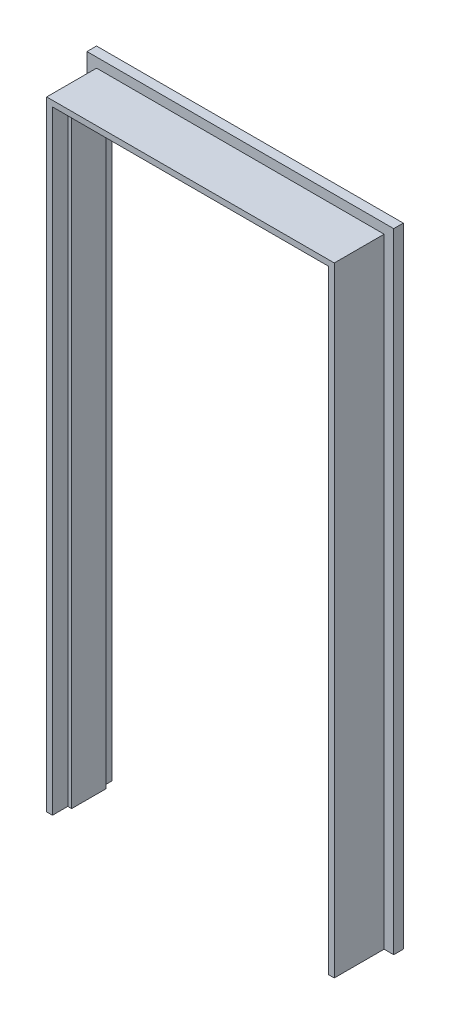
ISO-10303-21;
HEADER;
FILE_DESCRIPTION(('STEP AP214'),'2;1');
FILE_NAME('part.step','',(''),(''),'','','');
FILE_SCHEMA(('AUTOMOTIVE_DESIGN { 1 0 10303 214 1 1 1 1 }'));
ENDSEC;
DATA;
#1=APPLICATION_CONTEXT('core data for automotive mechanical design processes');
#2=APPLICATION_PROTOCOL_DEFINITION('international standard','automotive_design',2000,#1);
#3=PRODUCT_CONTEXT('',#1,'mechanical');
#4=PRODUCT('Part','Part','',(#3));
#5=PRODUCT_RELATED_PRODUCT_CATEGORY('part','',(#4));
#6=PRODUCT_DEFINITION_FORMATION('','',#4);
#7=PRODUCT_DEFINITION_CONTEXT('part definition',#1,'design');
#8=PRODUCT_DEFINITION('design','',#6,#7);
#9=PRODUCT_DEFINITION_SHAPE('','',#8);
#10=(LENGTH_UNIT() NAMED_UNIT(*) SI_UNIT(.MILLI.,.METRE.));
#11=(NAMED_UNIT(*) PLANE_ANGLE_UNIT() SI_UNIT($,.RADIAN.));
#12=(NAMED_UNIT(*) SI_UNIT($,.STERADIAN.) SOLID_ANGLE_UNIT());
#13=UNCERTAINTY_MEASURE_WITH_UNIT(LENGTH_MEASURE(1.E-05),#10,'distance_accuracy_value','');
#14=(GEOMETRIC_REPRESENTATION_CONTEXT(3) GLOBAL_UNCERTAINTY_ASSIGNED_CONTEXT((#13)) GLOBAL_UNIT_ASSIGNED_CONTEXT((#10,
#11,#12)) REPRESENTATION_CONTEXT('',''));
#15=CARTESIAN_POINT('',(0.,0.,0.));
#16=DIRECTION('',(0.,0.,1.));
#17=DIRECTION('',(1.,0.,0.));
#18=AXIS2_PLACEMENT_3D('',#15,#16,#17);
#19=CARTESIAN_POINT('',(457.2,0.,165.1));
#20=DIRECTION('',(1.,0.,0.));
#21=DIRECTION('',(0.,0.,-1.));
#22=AXIS2_PLACEMENT_3D('',#19,#20,#21);
#23=PLANE('',#22);
#24=DIRECTION('',(0.,1.,0.));
#25=VECTOR('',#24,1.);
#26=CARTESIAN_POINT('',(457.2,0.,114.3));
#27=LINE('',#26,#25);
#28=CARTESIAN_POINT('',(457.2,0.,114.3));
#29=VERTEX_POINT('',#28);
#30=CARTESIAN_POINT('',(457.2,2032.,114.3));
#31=VERTEX_POINT('',#30);
#32=EDGE_CURVE('E364',#29,#31,#27,.T.);
#33=ORIENTED_EDGE('',*,*,#32,.F.);
#34=DIRECTION('',(0.,0.,-1.));
#35=VECTOR('',#34,1.);
#36=CARTESIAN_POINT('',(457.2,0.,165.1));
#37=LINE('',#36,#35);
#38=CARTESIAN_POINT('',(457.2,0.,165.1));
#39=VERTEX_POINT('',#38);
#40=EDGE_CURVE('E11',#39,#29,#37,.T.);
#41=ORIENTED_EDGE('',*,*,#40,.F.);
#42=DIRECTION('',(0.,-1.,0.));
#43=VECTOR('',#42,1.);
#44=CARTESIAN_POINT('',(457.2,0.,165.1));
#45=LINE('',#44,#43);
#46=CARTESIAN_POINT('',(457.2,2032.,165.1));
#47=VERTEX_POINT('',#46);
#48=EDGE_CURVE('E231',#47,#39,#45,.T.);
#49=ORIENTED_EDGE('',*,*,#48,.F.);
#50=DIRECTION('',(0.,0.,-1.));
#51=VECTOR('',#50,1.);
#52=CARTESIAN_POINT('',(457.2,2032.,165.1));
#53=LINE('',#52,#51);
#54=EDGE_CURVE('E227',#47,#31,#53,.T.);
#55=ORIENTED_EDGE('',*,*,#54,.T.);
#56=EDGE_LOOP('',(#33,#41,#49,#55));
#57=FACE_BOUND('',#56,.T.);
#58=ADVANCED_FACE('F35',(#57),#23,.F.);
#59=CARTESIAN_POINT('',(-457.2,0.,165.1));
#60=DIRECTION('',(-1.,0.,0.));
#61=DIRECTION('',(0.,0.,1.));
#62=AXIS2_PLACEMENT_3D('',#59,#60,#61);
#63=PLANE('',#62);
#64=DIRECTION('',(0.,-1.,0.));
#65=VECTOR('',#64,1.);
#66=CARTESIAN_POINT('',(-457.2,-2.22044604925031E-13,114.3));
#67=LINE('',#66,#65);
#68=CARTESIAN_POINT('',(-457.2,2032.,114.3));
#69=VERTEX_POINT('',#68);
#70=CARTESIAN_POINT('',(-457.2,0.,114.3));
#71=VERTEX_POINT('',#70);
#72=EDGE_CURVE('E359',#69,#71,#67,.T.);
#73=ORIENTED_EDGE('',*,*,#72,.F.);
#74=DIRECTION('',(0.,0.,-1.));
#75=VECTOR('',#74,1.);
#76=CARTESIAN_POINT('',(-457.2,2032.,165.1));
#77=LINE('',#76,#75);
#78=CARTESIAN_POINT('',(-457.2,2032.,165.1));
#79=VERTEX_POINT('',#78);
#80=EDGE_CURVE('E308',#79,#69,#77,.T.);
#81=ORIENTED_EDGE('',*,*,#80,.F.);
#82=DIRECTION('',(0.,1.,0.));
#83=VECTOR('',#82,1.);
#84=CARTESIAN_POINT('',(-457.2,0.,165.1));
#85=LINE('',#84,#83);
#86=CARTESIAN_POINT('',(-457.2,0.,165.1));
#87=VERTEX_POINT('',#86);
#88=EDGE_CURVE('E320',#87,#79,#85,.T.);
#89=ORIENTED_EDGE('',*,*,#88,.F.);
#90=DIRECTION('',(0.,0.,-1.));
#91=VECTOR('',#90,1.);
#92=CARTESIAN_POINT('',(-457.2,0.,165.1));
#93=LINE('',#92,#91);
#94=EDGE_CURVE('E306',#87,#71,#93,.T.);
#95=ORIENTED_EDGE('',*,*,#94,.T.);
#96=EDGE_LOOP('',(#73,#81,#89,#95));
#97=FACE_BOUND('',#96,.T.);
#98=ADVANCED_FACE('F383',(#97),#63,.F.);
#99=CARTESIAN_POINT('',(-457.2,2032.,165.1));
#100=DIRECTION('',(0.,1.,0.));
#101=DIRECTION('',(0.,0.,1.));
#102=AXIS2_PLACEMENT_3D('',#99,#100,#101);
#103=PLANE('',#102);
#104=DIRECTION('',(-1.,0.,0.));
#105=VECTOR('',#104,1.);
#106=CARTESIAN_POINT('',(457.2,2032.,114.3));
#107=LINE('',#106,#105);
#108=EDGE_CURVE('E362',#31,#69,#107,.T.);
#109=ORIENTED_EDGE('',*,*,#108,.F.);
#110=ORIENTED_EDGE('',*,*,#54,.F.);
#111=DIRECTION('',(1.,0.,0.));
#112=VECTOR('',#111,1.);
#113=CARTESIAN_POINT('',(-457.2,2032.,165.1));
#114=LINE('',#113,#112);
#115=EDGE_CURVE('E315',#79,#47,#114,.T.);
#116=ORIENTED_EDGE('',*,*,#115,.F.);
#117=ORIENTED_EDGE('',*,*,#80,.T.);
#118=EDGE_LOOP('',(#109,#110,#116,#117));
#119=FACE_BOUND('',#118,.T.);
#120=ADVANCED_FACE('F384',(#119),#103,.F.);
#121=CARTESIAN_POINT('',(457.2,0.,165.1));
#122=DIRECTION('',(0.,1.,0.));
#123=DIRECTION('',(0.,0.,1.));
#124=AXIS2_PLACEMENT_3D('',#121,#122,#123);
#125=PLANE('',#124);
#126=DIRECTION('',(1.,0.,0.));
#127=VECTOR('',#126,1.);
#128=CARTESIAN_POINT('',(457.2,0.,0.));
#129=LINE('',#128,#127);
#130=CARTESIAN_POINT('',(444.5,0.,0.));
#131=VERTEX_POINT('',#130);
#132=CARTESIAN_POINT('',(457.2,0.,0.));
#133=VERTEX_POINT('',#132);
#134=EDGE_CURVE('E196',#131,#133,#129,.T.);
#135=ORIENTED_EDGE('',*,*,#134,.T.);
#136=DIRECTION('',(0.,0.,1.));
#137=VECTOR('',#136,1.);
#138=CARTESIAN_POINT('',(457.2,0.,-31.75));
#139=LINE('',#138,#137);
#140=CARTESIAN_POINT('',(457.2,0.,-31.75));
#141=VERTEX_POINT('',#140);
#142=EDGE_CURVE('E176',#141,#133,#139,.T.);
#143=ORIENTED_EDGE('',*,*,#142,.F.);
#144=DIRECTION('',(-1.,0.,0.));
#145=VECTOR('',#144,1.);
#146=CARTESIAN_POINT('',(-1802.65041251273,0.,-31.75));
#147=LINE('',#146,#145);
#148=CARTESIAN_POINT('',(508.,0.,-31.75));
#149=VERTEX_POINT('',#148);
#150=EDGE_CURVE('E182',#149,#141,#147,.T.);
#151=ORIENTED_EDGE('',*,*,#150,.F.);
#152=DIRECTION('',(0.,0.,1.));
#153=VECTOR('',#152,1.);
#154=CARTESIAN_POINT('',(508.,0.,-31.75));
#155=LINE('',#154,#153);
#156=CARTESIAN_POINT('',(508.,0.,0.));
#157=VERTEX_POINT('',#156);
#158=EDGE_CURVE('E276',#149,#157,#155,.T.);
#159=ORIENTED_EDGE('',*,*,#158,.T.);
#160=DIRECTION('',(-1.,0.,0.));
#161=VECTOR('',#160,1.);
#162=CARTESIAN_POINT('',(-1802.65041251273,0.,0.));
#163=LINE('',#162,#161);
#164=CARTESIAN_POINT('',(476.25,0.,0.));
#165=VERTEX_POINT('',#164);
#166=EDGE_CURVE('E234',#157,#165,#163,.T.);
#167=ORIENTED_EDGE('',*,*,#166,.T.);
#168=DIRECTION('',(0.,0.,-1.));
#169=VECTOR('',#168,1.);
#170=CARTESIAN_POINT('',(476.25,0.,165.1));
#171=LINE('',#170,#169);
#172=CARTESIAN_POINT('',(476.25,0.,165.1));
#173=VERTEX_POINT('',#172);
#174=EDGE_CURVE('E43',#173,#165,#171,.T.);
#175=ORIENTED_EDGE('',*,*,#174,.F.);
#176=DIRECTION('',(1.,0.,0.));
#177=VECTOR('',#176,1.);
#178=CARTESIAN_POINT('',(457.2,0.,165.1));
#179=LINE('',#178,#177);
#180=EDGE_CURVE('E332',#39,#173,#179,.T.);
#181=ORIENTED_EDGE('',*,*,#180,.F.);
#182=ORIENTED_EDGE('',*,*,#40,.T.);
#183=DIRECTION('',(1.,0.,0.));
#184=VECTOR('',#183,1.);
#185=CARTESIAN_POINT('',(457.2,0.,114.3));
#186=LINE('',#185,#184);
#187=CARTESIAN_POINT('',(444.5,0.,114.3));
#188=VERTEX_POINT('',#187);
#189=EDGE_CURVE('E350',#188,#29,#186,.T.);
#190=ORIENTED_EDGE('',*,*,#189,.F.);
#191=DIRECTION('',(0.,0.,-1.));
#192=VECTOR('',#191,1.);
#193=CARTESIAN_POINT('',(444.5,0.,114.3));
#194=LINE('',#193,#192);
#195=EDGE_CURVE('E344',#188,#131,#194,.T.);
#196=ORIENTED_EDGE('',*,*,#195,.T.);
#197=EDGE_LOOP('',(#135,#143,#151,#159,#167,#175,#181,#182,#190,#196));
#198=FACE_BOUND('',#197,.T.);
#199=ADVANCED_FACE('F194',(#198),#125,.F.);
#200=CARTESIAN_POINT('',(476.25,0.,165.1));
#201=DIRECTION('',(-1.,0.,0.));
#202=DIRECTION('',(0.,0.,1.));
#203=AXIS2_PLACEMENT_3D('',#200,#201,#202);
#204=PLANE('',#203);
#205=DIRECTION('',(0.,1.,0.));
#206=VECTOR('',#205,1.);
#207=CARTESIAN_POINT('',(476.25,0.,0.));
#208=LINE('',#207,#206);
#209=CARTESIAN_POINT('',(476.25,2051.05,0.));
#210=VERTEX_POINT('',#209);
#211=EDGE_CURVE('E213',#165,#210,#208,.T.);
#212=ORIENTED_EDGE('',*,*,#211,.T.);
#213=DIRECTION('',(0.,0.,-1.));
#214=VECTOR('',#213,1.);
#215=CARTESIAN_POINT('',(476.25,2051.05,165.1));
#216=LINE('',#215,#214);
#217=CARTESIAN_POINT('',(476.25,2051.05,165.1));
#218=VERTEX_POINT('',#217);
#219=EDGE_CURVE('E210',#218,#210,#216,.T.);
#220=ORIENTED_EDGE('',*,*,#219,.F.);
#221=DIRECTION('',(0.,1.,0.));
#222=VECTOR('',#221,1.);
#223=CARTESIAN_POINT('',(476.25,0.,165.1));
#224=LINE('',#223,#222);
#225=EDGE_CURVE('E330',#173,#218,#224,.T.);
#226=ORIENTED_EDGE('',*,*,#225,.F.);
#227=ORIENTED_EDGE('',*,*,#174,.T.);
#228=EDGE_LOOP('',(#212,#220,#226,#227));
#229=FACE_BOUND('',#228,.T.);
#230=ADVANCED_FACE('F376',(#229),#204,.F.);
#231=CARTESIAN_POINT('',(-476.25,2051.05,165.1));
#232=DIRECTION('',(0.,-1.,0.));
#233=DIRECTION('',(0.,0.,-1.));
#234=AXIS2_PLACEMENT_3D('',#231,#232,#233);
#235=PLANE('',#234);
#236=DIRECTION('',(-1.,0.,0.));
#237=VECTOR('',#236,1.);
#238=CARTESIAN_POINT('',(-476.25,2051.05,0.));
#239=LINE('',#238,#237);
#240=CARTESIAN_POINT('',(-476.25,2051.05,0.));
#241=VERTEX_POINT('',#240);
#242=EDGE_CURVE('E216',#210,#241,#239,.T.);
#243=ORIENTED_EDGE('',*,*,#242,.T.);
#244=DIRECTION('',(0.,0.,-1.));
#245=VECTOR('',#244,1.);
#246=CARTESIAN_POINT('',(-476.25,2051.05,165.1));
#247=LINE('',#246,#245);
#248=CARTESIAN_POINT('',(-476.25,2051.05,165.1));
#249=VERTEX_POINT('',#248);
#250=EDGE_CURVE('E299',#249,#241,#247,.T.);
#251=ORIENTED_EDGE('',*,*,#250,.F.);
#252=DIRECTION('',(-1.,0.,0.));
#253=VECTOR('',#252,1.);
#254=CARTESIAN_POINT('',(-476.25,2051.05,165.1));
#255=LINE('',#254,#253);
#256=EDGE_CURVE('E328',#218,#249,#255,.T.);
#257=ORIENTED_EDGE('',*,*,#256,.F.);
#258=ORIENTED_EDGE('',*,*,#219,.T.);
#259=EDGE_LOOP('',(#243,#251,#257,#258));
#260=FACE_BOUND('',#259,.T.);
#261=ADVANCED_FACE('F377',(#260),#235,.F.);
#262=CARTESIAN_POINT('',(-476.25,0.,165.1));
#263=DIRECTION('',(1.,0.,0.));
#264=DIRECTION('',(0.,0.,-1.));
#265=AXIS2_PLACEMENT_3D('',#262,#263,#264);
#266=PLANE('',#265);
#267=DIRECTION('',(0.,-1.,0.));
#268=VECTOR('',#267,1.);
#269=CARTESIAN_POINT('',(-476.25,0.,0.));
#270=LINE('',#269,#268);
#271=CARTESIAN_POINT('',(-476.25,0.,0.));
#272=VERTEX_POINT('',#271);
#273=EDGE_CURVE('E217',#241,#272,#270,.T.);
#274=ORIENTED_EDGE('',*,*,#273,.T.);
#275=DIRECTION('',(0.,0.,-1.));
#276=VECTOR('',#275,1.);
#277=CARTESIAN_POINT('',(-476.25,0.,165.1));
#278=LINE('',#277,#276);
#279=CARTESIAN_POINT('',(-476.25,0.,165.1));
#280=VERTEX_POINT('',#279);
#281=EDGE_CURVE('E289',#280,#272,#278,.T.);
#282=ORIENTED_EDGE('',*,*,#281,.F.);
#283=DIRECTION('',(0.,-1.,0.));
#284=VECTOR('',#283,1.);
#285=CARTESIAN_POINT('',(-476.25,0.,165.1));
#286=LINE('',#285,#284);
#287=EDGE_CURVE('E300',#249,#280,#286,.T.);
#288=ORIENTED_EDGE('',*,*,#287,.F.);
#289=ORIENTED_EDGE('',*,*,#250,.T.);
#290=EDGE_LOOP('',(#274,#282,#288,#289));
#291=FACE_BOUND('',#290,.T.);
#292=ADVANCED_FACE('F296',(#291),#266,.F.);
#293=CARTESIAN_POINT('',(-476.25,0.,165.1));
#294=DIRECTION('',(0.,1.,0.));
#295=DIRECTION('',(0.,0.,1.));
#296=AXIS2_PLACEMENT_3D('',#293,#294,#295);
#297=PLANE('',#296);
#298=ORIENTED_EDGE('',*,*,#281,.T.);
#299=DIRECTION('',(-1.,0.,0.));
#300=VECTOR('',#299,1.);
#301=CARTESIAN_POINT('',(-1802.65041251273,0.,0.));
#302=LINE('',#301,#300);
#303=CARTESIAN_POINT('',(-508.,0.,0.));
#304=VERTEX_POINT('',#303);
#305=EDGE_CURVE('E243',#272,#304,#302,.T.);
#306=ORIENTED_EDGE('',*,*,#305,.T.);
#307=DIRECTION('',(0.,0.,1.));
#308=VECTOR('',#307,1.);
#309=CARTESIAN_POINT('',(-508.,0.,-31.75));
#310=LINE('',#309,#308);
#311=CARTESIAN_POINT('',(-508.,0.,-31.75));
#312=VERTEX_POINT('',#311);
#313=EDGE_CURVE('E259',#312,#304,#310,.T.);
#314=ORIENTED_EDGE('',*,*,#313,.F.);
#315=DIRECTION('',(-1.,0.,0.));
#316=VECTOR('',#315,1.);
#317=CARTESIAN_POINT('',(-1802.65041251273,0.,-31.75));
#318=LINE('',#317,#316);
#319=CARTESIAN_POINT('',(-457.2,0.,-31.75));
#320=VERTEX_POINT('',#319);
#321=EDGE_CURVE('E405',#320,#312,#318,.T.);
#322=ORIENTED_EDGE('',*,*,#321,.F.);
#323=DIRECTION('',(0.,0.,1.));
#324=VECTOR('',#323,1.);
#325=CARTESIAN_POINT('',(-457.2,0.,-31.75));
#326=LINE('',#325,#324);
#327=CARTESIAN_POINT('',(-457.2,0.,0.));
#328=VERTEX_POINT('',#327);
#329=EDGE_CURVE('E257',#320,#328,#326,.T.);
#330=ORIENTED_EDGE('',*,*,#329,.T.);
#331=DIRECTION('',(1.,0.,0.));
#332=VECTOR('',#331,1.);
#333=CARTESIAN_POINT('',(-476.25,0.,0.));
#334=LINE('',#333,#332);
#335=CARTESIAN_POINT('',(-444.5,0.,0.));
#336=VERTEX_POINT('',#335);
#337=EDGE_CURVE('E56',#328,#336,#334,.T.);
#338=ORIENTED_EDGE('',*,*,#337,.T.);
#339=DIRECTION('',(0.,0.,-1.));
#340=VECTOR('',#339,1.);
#341=CARTESIAN_POINT('',(-444.5,0.,114.3));
#342=LINE('',#341,#340);
#343=CARTESIAN_POINT('',(-444.5,0.,114.3));
#344=VERTEX_POINT('',#343);
#345=EDGE_CURVE('E335',#344,#336,#342,.T.);
#346=ORIENTED_EDGE('',*,*,#345,.F.);
#347=DIRECTION('',(1.,0.,0.));
#348=VECTOR('',#347,1.);
#349=CARTESIAN_POINT('',(-457.2,-2.22044604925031E-13,114.3));
#350=LINE('',#349,#348);
#351=EDGE_CURVE('E357',#71,#344,#350,.T.);
#352=ORIENTED_EDGE('',*,*,#351,.F.);
#353=ORIENTED_EDGE('',*,*,#94,.F.);
#354=DIRECTION('',(1.,0.,0.));
#355=VECTOR('',#354,1.);
#356=CARTESIAN_POINT('',(-476.25,0.,165.1));
#357=LINE('',#356,#355);
#358=EDGE_CURVE('E323',#280,#87,#357,.T.);
#359=ORIENTED_EDGE('',*,*,#358,.F.);
#360=EDGE_LOOP('',(#298,#306,#314,#322,#330,#338,#346,#352,#353,#359));
#361=FACE_BOUND('',#360,.T.);
#362=ADVANCED_FACE('F286',(#361),#297,.F.);
#363=CARTESIAN_POINT('',(457.2,2032.,165.1));
#364=DIRECTION('',(0.,0.,-1.));
#365=DIRECTION('',(-1.,0.,0.));
#366=AXIS2_PLACEMENT_3D('',#363,#364,#365);
#367=PLANE('',#366);
#368=ORIENTED_EDGE('',*,*,#48,.T.);
#369=ORIENTED_EDGE('',*,*,#180,.T.);
#370=ORIENTED_EDGE('',*,*,#225,.T.);
#371=ORIENTED_EDGE('',*,*,#256,.T.);
#372=ORIENTED_EDGE('',*,*,#287,.T.);
#373=ORIENTED_EDGE('',*,*,#358,.T.);
#374=ORIENTED_EDGE('',*,*,#88,.T.);
#375=ORIENTED_EDGE('',*,*,#115,.T.);
#376=EDGE_LOOP('',(#368,#369,#370,#371,#372,#373,#374,#375));
#377=FACE_BOUND('',#376,.T.);
#378=ADVANCED_FACE('F372',(#377),#367,.F.);
#379=CARTESIAN_POINT('',(457.2,2032.,0.));
#380=DIRECTION('',(0.,0.,-1.));
#381=DIRECTION('',(-1.,0.,0.));
#382=AXIS2_PLACEMENT_3D('',#379,#380,#381);
#383=PLANE('',#382);
#384=DIRECTION('',(0.,-1.,0.));
#385=VECTOR('',#384,1.);
#386=CARTESIAN_POINT('',(-457.2,1041.4,0.));
#387=LINE('',#386,#385);
#388=CARTESIAN_POINT('',(-457.2,2032.,0.));
#389=VERTEX_POINT('',#388);
#390=EDGE_CURVE('E51',#389,#328,#387,.T.);
#391=ORIENTED_EDGE('',*,*,#390,.F.);
#392=DIRECTION('',(-1.,0.,0.));
#393=VECTOR('',#392,1.);
#394=CARTESIAN_POINT('',(-1802.65041251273,2032.,0.));
#395=LINE('',#394,#393);
#396=CARTESIAN_POINT('',(457.2,2032.,0.));
#397=VERTEX_POINT('',#396);
#398=EDGE_CURVE('E233',#397,#389,#395,.T.);
#399=ORIENTED_EDGE('',*,*,#398,.F.);
#400=DIRECTION('',(0.,1.,0.));
#401=VECTOR('',#400,1.);
#402=CARTESIAN_POINT('',(457.2,1041.4,0.));
#403=LINE('',#402,#401);
#404=EDGE_CURVE('E232',#133,#397,#403,.T.);
#405=ORIENTED_EDGE('',*,*,#404,.F.);
#406=ORIENTED_EDGE('',*,*,#134,.F.);
#407=DIRECTION('',(0.,-1.,0.));
#408=VECTOR('',#407,1.);
#409=CARTESIAN_POINT('',(444.5,0.,0.));
#410=LINE('',#409,#408);
#411=CARTESIAN_POINT('',(444.5,2019.3,0.));
#412=VERTEX_POINT('',#411);
#413=EDGE_CURVE('E347',#412,#131,#410,.T.);
#414=ORIENTED_EDGE('',*,*,#413,.F.);
#415=DIRECTION('',(1.,0.,0.));
#416=VECTOR('',#415,1.);
#417=CARTESIAN_POINT('',(444.5,2019.3,0.));
#418=LINE('',#417,#416);
#419=CARTESIAN_POINT('',(-444.5,2019.3,0.));
#420=VERTEX_POINT('',#419);
#421=EDGE_CURVE('E199',#420,#412,#418,.T.);
#422=ORIENTED_EDGE('',*,*,#421,.F.);
#423=DIRECTION('',(0.,1.,0.));
#424=VECTOR('',#423,1.);
#425=CARTESIAN_POINT('',(-444.5,0.,0.));
#426=LINE('',#425,#424);
#427=EDGE_CURVE('E197',#336,#420,#426,.T.);
#428=ORIENTED_EDGE('',*,*,#427,.F.);
#429=ORIENTED_EDGE('',*,*,#337,.F.);
#430=EDGE_LOOP('',(#391,#399,#405,#406,#414,#422,#428,#429));
#431=FACE_BOUND('',#430,.T.);
#432=ADVANCED_FACE('F397',(#431),#383,.T.);
#433=CARTESIAN_POINT('',(-444.5,0.,114.3));
#434=DIRECTION('',(-1.,0.,0.));
#435=DIRECTION('',(0.,0.,1.));
#436=AXIS2_PLACEMENT_3D('',#433,#434,#435);
#437=PLANE('',#436);
#438=ORIENTED_EDGE('',*,*,#427,.T.);
#439=DIRECTION('',(0.,0.,-1.));
#440=VECTOR('',#439,1.);
#441=CARTESIAN_POINT('',(-444.5,2019.3,114.3));
#442=LINE('',#441,#440);
#443=CARTESIAN_POINT('',(-444.5,2019.3,114.3));
#444=VERTEX_POINT('',#443);
#445=EDGE_CURVE('E338',#444,#420,#442,.T.);
#446=ORIENTED_EDGE('',*,*,#445,.F.);
#447=DIRECTION('',(0.,1.,0.));
#448=VECTOR('',#447,1.);
#449=CARTESIAN_POINT('',(-444.5,0.,114.3));
#450=LINE('',#449,#448);
#451=EDGE_CURVE('E355',#344,#444,#450,.T.);
#452=ORIENTED_EDGE('',*,*,#451,.F.);
#453=ORIENTED_EDGE('',*,*,#345,.T.);
#454=EDGE_LOOP('',(#438,#446,#452,#453));
#455=FACE_BOUND('',#454,.T.);
#456=ADVANCED_FACE('F388',(#455),#437,.F.);
#457=CARTESIAN_POINT('',(444.5,2019.3,114.3));
#458=DIRECTION('',(0.,1.,0.));
#459=DIRECTION('',(0.,0.,1.));
#460=AXIS2_PLACEMENT_3D('',#457,#458,#459);
#461=PLANE('',#460);
#462=ORIENTED_EDGE('',*,*,#421,.T.);
#463=DIRECTION('',(0.,0.,-1.));
#464=VECTOR('',#463,1.);
#465=CARTESIAN_POINT('',(444.5,2019.3,114.3));
#466=LINE('',#465,#464);
#467=CARTESIAN_POINT('',(444.5,2019.3,114.3));
#468=VERTEX_POINT('',#467);
#469=EDGE_CURVE('E341',#468,#412,#466,.T.);
#470=ORIENTED_EDGE('',*,*,#469,.F.);
#471=DIRECTION('',(1.,0.,0.));
#472=VECTOR('',#471,1.);
#473=CARTESIAN_POINT('',(444.5,2019.3,114.3));
#474=LINE('',#473,#472);
#475=EDGE_CURVE('E353',#444,#468,#474,.T.);
#476=ORIENTED_EDGE('',*,*,#475,.F.);
#477=ORIENTED_EDGE('',*,*,#445,.T.);
#478=EDGE_LOOP('',(#462,#470,#476,#477));
#479=FACE_BOUND('',#478,.T.);
#480=ADVANCED_FACE('F393',(#479),#461,.F.);
#481=CARTESIAN_POINT('',(444.5,0.,114.3));
#482=DIRECTION('',(1.,0.,0.));
#483=DIRECTION('',(0.,0.,-1.));
#484=AXIS2_PLACEMENT_3D('',#481,#482,#483);
#485=PLANE('',#484);
#486=ORIENTED_EDGE('',*,*,#413,.T.);
#487=ORIENTED_EDGE('',*,*,#195,.F.);
#488=DIRECTION('',(0.,-1.,0.));
#489=VECTOR('',#488,1.);
#490=CARTESIAN_POINT('',(444.5,0.,114.3));
#491=LINE('',#490,#489);
#492=EDGE_CURVE('E346',#468,#188,#491,.T.);
#493=ORIENTED_EDGE('',*,*,#492,.F.);
#494=ORIENTED_EDGE('',*,*,#469,.T.);
#495=EDGE_LOOP('',(#486,#487,#493,#494));
#496=FACE_BOUND('',#495,.T.);
#497=ADVANCED_FACE('F396',(#496),#485,.F.);
#498=CARTESIAN_POINT('',(444.5,0.,114.3));
#499=DIRECTION('',(0.,0.,-1.));
#500=DIRECTION('',(-1.,0.,0.));
#501=AXIS2_PLACEMENT_3D('',#498,#499,#500);
#502=PLANE('',#501);
#503=ORIENTED_EDGE('',*,*,#189,.T.);
#504=ORIENTED_EDGE('',*,*,#32,.T.);
#505=ORIENTED_EDGE('',*,*,#108,.T.);
#506=ORIENTED_EDGE('',*,*,#72,.T.);
#507=ORIENTED_EDGE('',*,*,#351,.T.);
#508=ORIENTED_EDGE('',*,*,#451,.T.);
#509=ORIENTED_EDGE('',*,*,#475,.T.);
#510=ORIENTED_EDGE('',*,*,#492,.T.);
#511=EDGE_LOOP('',(#503,#504,#505,#506,#507,#508,#509,#510));
#512=FACE_BOUND('',#511,.T.);
#513=ADVANCED_FACE('F368',(#512),#502,.F.);
#514=CARTESIAN_POINT('',(457.2,1041.4,-31.75));
#515=DIRECTION('',(1.,0.,0.));
#516=DIRECTION('',(0.,0.,-1.));
#517=AXIS2_PLACEMENT_3D('',#514,#515,#516);
#518=PLANE('',#517);
#519=ORIENTED_EDGE('',*,*,#404,.T.);
#520=DIRECTION('',(0.,0.,1.));
#521=VECTOR('',#520,1.);
#522=CARTESIAN_POINT('',(457.2,2032.,-31.75));
#523=LINE('',#522,#521);
#524=CARTESIAN_POINT('',(457.2,2032.,-31.75));
#525=VERTEX_POINT('',#524);
#526=EDGE_CURVE('E178',#525,#397,#523,.T.);
#527=ORIENTED_EDGE('',*,*,#526,.F.);
#528=DIRECTION('',(0.,1.,0.));
#529=VECTOR('',#528,1.);
#530=CARTESIAN_POINT('',(457.2,1041.4,-31.75));
#531=LINE('',#530,#529);
#532=EDGE_CURVE('E171',#141,#525,#531,.T.);
#533=ORIENTED_EDGE('',*,*,#532,.F.);
#534=ORIENTED_EDGE('',*,*,#142,.T.);
#535=EDGE_LOOP('',(#519,#527,#533,#534));
#536=FACE_BOUND('',#535,.T.);
#537=ADVANCED_FACE('F174',(#536),#518,.F.);
#538=CARTESIAN_POINT('',(-1802.65041251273,2032.,-31.75));
#539=DIRECTION('',(0.,1.,0.));
#540=DIRECTION('',(0.,0.,1.));
#541=AXIS2_PLACEMENT_3D('',#538,#539,#540);
#542=PLANE('',#541);
#543=ORIENTED_EDGE('',*,*,#398,.T.);
#544=DIRECTION('',(0.,0.,1.));
#545=VECTOR('',#544,1.);
#546=CARTESIAN_POINT('',(-457.2,2032.,-31.75));
#547=LINE('',#546,#545);
#548=CARTESIAN_POINT('',(-457.2,2032.,-31.75));
#549=VERTEX_POINT('',#548);
#550=EDGE_CURVE('E201',#549,#389,#547,.T.);
#551=ORIENTED_EDGE('',*,*,#550,.F.);
#552=DIRECTION('',(-1.,0.,0.));
#553=VECTOR('',#552,1.);
#554=CARTESIAN_POINT('',(-1802.65041251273,2032.,-31.75));
#555=LINE('',#554,#553);
#556=EDGE_CURVE('E181',#525,#549,#555,.T.);
#557=ORIENTED_EDGE('',*,*,#556,.F.);
#558=ORIENTED_EDGE('',*,*,#526,.T.);
#559=EDGE_LOOP('',(#543,#551,#557,#558));
#560=FACE_BOUND('',#559,.T.);
#561=ADVANCED_FACE('F400',(#560),#542,.F.);
#562=CARTESIAN_POINT('',(-457.2,1041.4,-31.75));
#563=DIRECTION('',(-1.,0.,0.));
#564=DIRECTION('',(0.,0.,1.));
#565=AXIS2_PLACEMENT_3D('',#562,#563,#564);
#566=PLANE('',#565);
#567=ORIENTED_EDGE('',*,*,#390,.T.);
#568=ORIENTED_EDGE('',*,*,#329,.F.);
#569=DIRECTION('',(0.,-1.,0.));
#570=VECTOR('',#569,1.);
#571=CARTESIAN_POINT('',(-457.2,1041.4,-31.75));
#572=LINE('',#571,#570);
#573=EDGE_CURVE('E404',#549,#320,#572,.T.);
#574=ORIENTED_EDGE('',*,*,#573,.F.);
#575=ORIENTED_EDGE('',*,*,#550,.T.);
#576=EDGE_LOOP('',(#567,#568,#574,#575));
#577=FACE_BOUND('',#576,.T.);
#578=ADVANCED_FACE('F403',(#577),#566,.F.);
#579=CARTESIAN_POINT('',(-508.,1041.4,-31.75));
#580=DIRECTION('',(-1.,0.,0.));
#581=DIRECTION('',(0.,-1.,0.));
#582=AXIS2_PLACEMENT_3D('',#579,#580,#581);
#583=PLANE('',#582);
#584=DIRECTION('',(0.,-1.,0.));
#585=VECTOR('',#584,1.);
#586=CARTESIAN_POINT('',(-508.,1041.4,0.));
#587=LINE('',#586,#585);
#588=CARTESIAN_POINT('',(-508.,2082.8,0.));
#589=VERTEX_POINT('',#588);
#590=EDGE_CURVE('E282',#589,#304,#587,.T.);
#591=ORIENTED_EDGE('',*,*,#590,.F.);
#592=DIRECTION('',(0.,0.,1.));
#593=VECTOR('',#592,1.);
#594=CARTESIAN_POINT('',(-508.,2082.8,-31.75));
#595=LINE('',#594,#593);
#596=CARTESIAN_POINT('',(-508.,2082.8,-31.75));
#597=VERTEX_POINT('',#596);
#598=EDGE_CURVE('E265',#597,#589,#595,.T.);
#599=ORIENTED_EDGE('',*,*,#598,.F.);
#600=DIRECTION('',(0.,-1.,0.));
#601=VECTOR('',#600,1.);
#602=CARTESIAN_POINT('',(-508.,1041.4,-31.75));
#603=LINE('',#602,#601);
#604=EDGE_CURVE('E407',#597,#312,#603,.T.);
#605=ORIENTED_EDGE('',*,*,#604,.T.);
#606=ORIENTED_EDGE('',*,*,#313,.T.);
#607=EDGE_LOOP('',(#591,#599,#605,#606));
#608=FACE_BOUND('',#607,.T.);
#609=ADVANCED_FACE('F420',(#608),#583,.T.);
#610=CARTESIAN_POINT('',(-1802.65041251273,2082.8,-31.75));
#611=DIRECTION('',(0.,1.,0.));
#612=DIRECTION('',(0.,0.,1.));
#613=AXIS2_PLACEMENT_3D('',#610,#611,#612);
#614=PLANE('',#613);
#615=DIRECTION('',(-1.,0.,0.));
#616=VECTOR('',#615,1.);
#617=CARTESIAN_POINT('',(-1802.65041251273,2082.8,0.));
#618=LINE('',#617,#616);
#619=CARTESIAN_POINT('',(508.,2082.8,0.));
#620=VERTEX_POINT('',#619);
#621=EDGE_CURVE('E280',#620,#589,#618,.T.);
#622=ORIENTED_EDGE('',*,*,#621,.F.);
#623=DIRECTION('',(0.,0.,1.));
#624=VECTOR('',#623,1.);
#625=CARTESIAN_POINT('',(508.,2082.8,-31.75));
#626=LINE('',#625,#624);
#627=CARTESIAN_POINT('',(508.,2082.8,-31.75));
#628=VERTEX_POINT('',#627);
#629=EDGE_CURVE('E272',#628,#620,#626,.T.);
#630=ORIENTED_EDGE('',*,*,#629,.F.);
#631=DIRECTION('',(-1.,0.,0.));
#632=VECTOR('',#631,1.);
#633=CARTESIAN_POINT('',(-1802.65041251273,2082.8,-31.75));
#634=LINE('',#633,#632);
#635=EDGE_CURVE('E411',#628,#597,#634,.T.);
#636=ORIENTED_EDGE('',*,*,#635,.T.);
#637=ORIENTED_EDGE('',*,*,#598,.T.);
#638=EDGE_LOOP('',(#622,#630,#636,#637));
#639=FACE_BOUND('',#638,.T.);
#640=ADVANCED_FACE('F418',(#639),#614,.T.);
#641=CARTESIAN_POINT('',(508.,1041.4,-31.75));
#642=DIRECTION('',(1.,0.,0.));
#643=DIRECTION('',(0.,0.,-1.));
#644=AXIS2_PLACEMENT_3D('',#641,#642,#643);
#645=PLANE('',#644);
#646=DIRECTION('',(0.,1.,0.));
#647=VECTOR('',#646,1.);
#648=CARTESIAN_POINT('',(508.,1041.4,0.));
#649=LINE('',#648,#647);
#650=EDGE_CURVE('E191',#157,#620,#649,.T.);
#651=ORIENTED_EDGE('',*,*,#650,.F.);
#652=ORIENTED_EDGE('',*,*,#158,.F.);
#653=DIRECTION('',(0.,1.,0.));
#654=VECTOR('',#653,1.);
#655=CARTESIAN_POINT('',(508.,1041.4,-31.75));
#656=LINE('',#655,#654);
#657=EDGE_CURVE('E189',#149,#628,#656,.T.);
#658=ORIENTED_EDGE('',*,*,#657,.T.);
#659=ORIENTED_EDGE('',*,*,#629,.T.);
#660=EDGE_LOOP('',(#651,#652,#658,#659));
#661=FACE_BOUND('',#660,.T.);
#662=ADVANCED_FACE('F416',(#661),#645,.T.);
#663=CARTESIAN_POINT('',(-1802.65041251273,1041.4,-31.75));
#664=DIRECTION('',(0.,0.,-1.));
#665=DIRECTION('',(-1.,0.,0.));
#666=AXIS2_PLACEMENT_3D('',#663,#664,#665);
#667=PLANE('',#666);
#668=ORIENTED_EDGE('',*,*,#150,.T.);
#669=ORIENTED_EDGE('',*,*,#532,.T.);
#670=ORIENTED_EDGE('',*,*,#556,.T.);
#671=ORIENTED_EDGE('',*,*,#573,.T.);
#672=ORIENTED_EDGE('',*,*,#321,.T.);
#673=ORIENTED_EDGE('',*,*,#604,.F.);
#674=ORIENTED_EDGE('',*,*,#635,.F.);
#675=ORIENTED_EDGE('',*,*,#657,.F.);
#676=EDGE_LOOP('',(#668,#669,#670,#671,#672,#673,#674,#675));
#677=FACE_BOUND('',#676,.T.);
#678=ADVANCED_FACE('F186',(#677),#667,.T.);
#679=CARTESIAN_POINT('',(-1802.65041251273,1041.4,0.));
#680=DIRECTION('',(0.,0.,-1.));
#681=DIRECTION('',(-1.,0.,0.));
#682=AXIS2_PLACEMENT_3D('',#679,#680,#681);
#683=PLANE('',#682);
#684=ORIENTED_EDGE('',*,*,#273,.F.);
#685=ORIENTED_EDGE('',*,*,#242,.F.);
#686=ORIENTED_EDGE('',*,*,#211,.F.);
#687=ORIENTED_EDGE('',*,*,#166,.F.);
#688=ORIENTED_EDGE('',*,*,#650,.T.);
#689=ORIENTED_EDGE('',*,*,#621,.T.);
#690=ORIENTED_EDGE('',*,*,#590,.T.);
#691=ORIENTED_EDGE('',*,*,#305,.F.);
#692=EDGE_LOOP('',(#684,#685,#686,#687,#688,#689,#690,#691));
#693=FACE_BOUND('',#692,.T.);
#694=ADVANCED_FACE('F291',(#693),#683,.F.);
#695=CLOSED_SHELL('',(#58,#98,#120,#199,#230,#261,#292,#362,#378,#432,#456,#480,#497,#513,#537,
#561,#578,#609,#640,#662,#678,#694));
#696=MANIFOLD_SOLID_BREP('B2',#695);
#697=ADVANCED_BREP_SHAPE_REPRESENTATION('',(#18,#696),#14);
#698=SHAPE_DEFINITION_REPRESENTATION(#9,#697);
ENDSEC;
END-ISO-10303-21;
